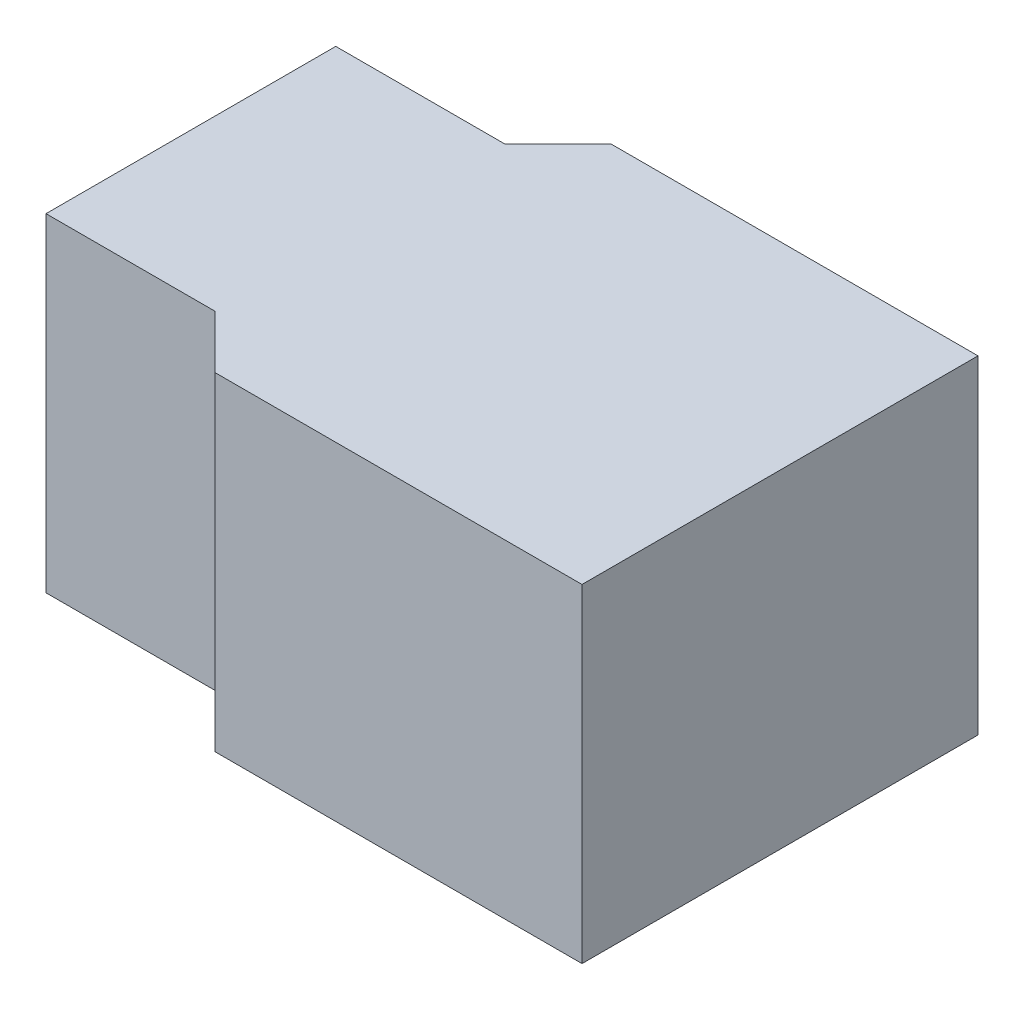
ISO-10303-21;
HEADER;
FILE_DESCRIPTION(('STEP AP214'),'2;1');
FILE_NAME('part.step','',(''),(''),'','','');
FILE_SCHEMA(('AUTOMOTIVE_DESIGN { 1 0 10303 214 1 1 1 1 }'));
ENDSEC;
DATA;
#1=APPLICATION_CONTEXT('core data for automotive mechanical design processes');
#2=APPLICATION_PROTOCOL_DEFINITION('international standard','automotive_design',2000,#1);
#3=PRODUCT_CONTEXT('',#1,'mechanical');
#4=PRODUCT('Part','Part','',(#3));
#5=PRODUCT_RELATED_PRODUCT_CATEGORY('part','',(#4));
#6=PRODUCT_DEFINITION_FORMATION('','',#4);
#7=PRODUCT_DEFINITION_CONTEXT('part definition',#1,'design');
#8=PRODUCT_DEFINITION('design','',#6,#7);
#9=PRODUCT_DEFINITION_SHAPE('','',#8);
#10=(LENGTH_UNIT() NAMED_UNIT(*) SI_UNIT(.MILLI.,.METRE.));
#11=(NAMED_UNIT(*) PLANE_ANGLE_UNIT() SI_UNIT($,.RADIAN.));
#12=(NAMED_UNIT(*) SI_UNIT($,.STERADIAN.) SOLID_ANGLE_UNIT());
#13=UNCERTAINTY_MEASURE_WITH_UNIT(LENGTH_MEASURE(1.E-05),#10,'distance_accuracy_value','');
#14=(GEOMETRIC_REPRESENTATION_CONTEXT(3) GLOBAL_UNCERTAINTY_ASSIGNED_CONTEXT((#13)) GLOBAL_UNIT_ASSIGNED_CONTEXT((#10,
#11,#12)) REPRESENTATION_CONTEXT('',''));
#15=CARTESIAN_POINT('',(0.,0.,0.));
#16=DIRECTION('',(0.,0.,1.));
#17=DIRECTION('',(1.,0.,0.));
#18=AXIS2_PLACEMENT_3D('',#15,#16,#17);
#19=CARTESIAN_POINT('',(0.,0.34,0.));
#20=DIRECTION('',(0.,1.,0.));
#21=DIRECTION('',(0.,0.,1.));
#22=AXIS2_PLACEMENT_3D('',#19,#20,#21);
#23=PLANE('',#22);
#24=DIRECTION('',(0.,0.,1.));
#25=VECTOR('',#24,1.);
#26=CARTESIAN_POINT('',(-3.,0.34,0.));
#27=LINE('',#26,#25);
#28=CARTESIAN_POINT('',(-3.,0.34,-1.755));
#29=VERTEX_POINT('',#28);
#30=CARTESIAN_POINT('',(-3.,0.34,-2.055));
#31=VERTEX_POINT('',#30);
#32=EDGE_CURVE('E114',#29,#31,#27,.F.);
#33=ORIENTED_EDGE('',*,*,#32,.F.);
#34=DIRECTION('',(1.,0.,0.));
#35=VECTOR('',#34,1.);
#36=CARTESIAN_POINT('',(0.,0.34,-1.755));
#37=LINE('',#36,#35);
#38=CARTESIAN_POINT('',(-2.825,0.339999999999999,-1.755));
#39=VERTEX_POINT('',#38);
#40=EDGE_CURVE('E118',#39,#29,#37,.F.);
#41=ORIENTED_EDGE('',*,*,#40,.F.);
#42=DIRECTION('',(0.707106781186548,0.,0.707106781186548));
#43=VECTOR('',#42,1.);
#44=CARTESIAN_POINT('',(-0.535,0.339999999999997,0.535));
#45=LINE('',#44,#43);
#46=CARTESIAN_POINT('',(-2.77,0.339999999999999,-1.7));
#47=VERTEX_POINT('',#46);
#48=EDGE_CURVE('E95',#47,#39,#45,.F.);
#49=ORIENTED_EDGE('',*,*,#48,.F.);
#50=DIRECTION('',(1.,0.,0.));
#51=VECTOR('',#50,1.);
#52=CARTESIAN_POINT('',(0.,0.34,-1.7));
#53=LINE('',#52,#51);
#54=CARTESIAN_POINT('',(-2.39,0.34,-1.7));
#55=VERTEX_POINT('',#54);
#56=EDGE_CURVE('E20',#55,#47,#53,.F.);
#57=ORIENTED_EDGE('',*,*,#56,.F.);
#58=DIRECTION('',(0.,0.,-1.));
#59=VECTOR('',#58,1.);
#60=CARTESIAN_POINT('',(-2.39,0.34,0.));
#61=LINE('',#60,#59);
#62=CARTESIAN_POINT('',(-2.39,0.34,-2.11));
#63=VERTEX_POINT('',#62);
#64=EDGE_CURVE('E83',#63,#55,#61,.F.);
#65=ORIENTED_EDGE('',*,*,#64,.F.);
#66=DIRECTION('',(-1.,0.,0.));
#67=VECTOR('',#66,1.);
#68=CARTESIAN_POINT('',(0.,0.34,-2.11));
#69=LINE('',#68,#67);
#70=CARTESIAN_POINT('',(-2.77,0.339999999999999,-2.11));
#71=VERTEX_POINT('',#70);
#72=EDGE_CURVE('E78',#71,#63,#69,.F.);
#73=ORIENTED_EDGE('',*,*,#72,.F.);
#74=DIRECTION('',(-0.707106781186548,0.,0.707106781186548));
#75=VECTOR('',#74,1.);
#76=CARTESIAN_POINT('',(-2.44,0.339999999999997,-2.44));
#77=LINE('',#76,#75);
#78=CARTESIAN_POINT('',(-2.825,0.339999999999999,-2.055));
#79=VERTEX_POINT('',#78);
#80=EDGE_CURVE('E106',#79,#71,#77,.F.);
#81=ORIENTED_EDGE('',*,*,#80,.F.);
#82=DIRECTION('',(-1.,0.,0.));
#83=VECTOR('',#82,1.);
#84=CARTESIAN_POINT('',(0.,0.34,-2.055));
#85=LINE('',#84,#83);
#86=EDGE_CURVE('E110',#31,#79,#85,.F.);
#87=ORIENTED_EDGE('',*,*,#86,.F.);
#88=EDGE_LOOP('',(#33,#41,#49,#57,#65,#73,#81,#87));
#89=FACE_BOUND('',#88,.T.);
#90=ADVANCED_FACE('F17',(#89),#23,.T.);
#91=CARTESIAN_POINT('',(0.,6.852610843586,-1.7));
#92=DIRECTION('',(0.,0.,1.));
#93=DIRECTION('',(1.,0.,0.));
#94=AXIS2_PLACEMENT_3D('',#91,#92,#93);
#95=PLANE('',#94);
#96=DIRECTION('',(0.,1.,0.));
#97=VECTOR('',#96,1.);
#98=CARTESIAN_POINT('',(-2.77,6.852610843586,-1.7));
#99=LINE('',#98,#97);
#100=CARTESIAN_POINT('',(-2.77,0.,-1.7));
#101=VERTEX_POINT('',#100);
#102=EDGE_CURVE('E122',#101,#47,#99,.T.);
#103=ORIENTED_EDGE('',*,*,#102,.F.);
#104=DIRECTION('',(1.,0.,0.));
#105=VECTOR('',#104,1.);
#106=CARTESIAN_POINT('',(0.,0.,-1.7));
#107=LINE('',#106,#105);
#108=CARTESIAN_POINT('',(-2.39,0.,-1.7));
#109=VERTEX_POINT('',#108);
#110=EDGE_CURVE('E101',#101,#109,#107,.T.);
#111=ORIENTED_EDGE('',*,*,#110,.T.);
#112=DIRECTION('',(0.,1.,0.));
#113=VECTOR('',#112,1.);
#114=CARTESIAN_POINT('',(-2.39,6.852610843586,-1.7));
#115=LINE('',#114,#113);
#116=EDGE_CURVE('E88',#55,#109,#115,.F.);
#117=ORIENTED_EDGE('',*,*,#116,.F.);
#118=ORIENTED_EDGE('',*,*,#56,.T.);
#119=EDGE_LOOP('',(#103,#111,#117,#118));
#120=FACE_BOUND('',#119,.T.);
#121=ADVANCED_FACE('F100',(#120),#95,.T.);
#122=CARTESIAN_POINT('',(-2.39,6.852610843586,0.));
#123=DIRECTION('',(1.,0.,0.));
#124=DIRECTION('',(0.,0.,-1.));
#125=AXIS2_PLACEMENT_3D('',#122,#123,#124);
#126=PLANE('',#125);
#127=ORIENTED_EDGE('',*,*,#116,.T.);
#128=DIRECTION('',(0.,0.,1.));
#129=VECTOR('',#128,1.);
#130=CARTESIAN_POINT('',(-2.39,0.,0.));
#131=LINE('',#130,#129);
#132=CARTESIAN_POINT('',(-2.39,0.,-2.11));
#133=VERTEX_POINT('',#132);
#134=EDGE_CURVE('E127',#109,#133,#131,.F.);
#135=ORIENTED_EDGE('',*,*,#134,.T.);
#136=DIRECTION('',(0.,1.,0.));
#137=VECTOR('',#136,1.);
#138=CARTESIAN_POINT('',(-2.39,6.852610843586,-2.11));
#139=LINE('',#138,#137);
#140=EDGE_CURVE('E90',#63,#133,#139,.F.);
#141=ORIENTED_EDGE('',*,*,#140,.F.);
#142=ORIENTED_EDGE('',*,*,#64,.T.);
#143=EDGE_LOOP('',(#127,#135,#141,#142));
#144=FACE_BOUND('',#143,.T.);
#145=ADVANCED_FACE('F85',(#144),#126,.T.);
#146=CARTESIAN_POINT('',(0.,6.852610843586,-2.11));
#147=DIRECTION('',(0.,0.,-1.));
#148=DIRECTION('',(-1.,0.,0.));
#149=AXIS2_PLACEMENT_3D('',#146,#147,#148);
#150=PLANE('',#149);
#151=ORIENTED_EDGE('',*,*,#140,.T.);
#152=DIRECTION('',(1.,0.,0.));
#153=VECTOR('',#152,1.);
#154=CARTESIAN_POINT('',(0.,0.,-2.11));
#155=LINE('',#154,#153);
#156=CARTESIAN_POINT('',(-2.77,0.,-2.11));
#157=VERTEX_POINT('',#156);
#158=EDGE_CURVE('E129',#133,#157,#155,.F.);
#159=ORIENTED_EDGE('',*,*,#158,.T.);
#160=DIRECTION('',(0.,1.,0.));
#161=VECTOR('',#160,1.);
#162=CARTESIAN_POINT('',(-2.77,6.852610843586,-2.11));
#163=LINE('',#162,#161);
#164=EDGE_CURVE('E108',#71,#157,#163,.F.);
#165=ORIENTED_EDGE('',*,*,#164,.F.);
#166=ORIENTED_EDGE('',*,*,#72,.T.);
#167=EDGE_LOOP('',(#151,#159,#165,#166));
#168=FACE_BOUND('',#167,.T.);
#169=ADVANCED_FACE('F162',(#168),#150,.T.);
#170=CARTESIAN_POINT('',(-2.44,6.852610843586,-2.44));
#171=DIRECTION('',(-0.707106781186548,0.,-0.707106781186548));
#172=DIRECTION('',(-0.707106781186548,0.,0.707106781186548));
#173=AXIS2_PLACEMENT_3D('',#170,#171,#172);
#174=PLANE('',#173);
#175=ORIENTED_EDGE('',*,*,#164,.T.);
#176=DIRECTION('',(-0.707106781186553,0.,0.707106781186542));
#177=VECTOR('',#176,1.);
#178=CARTESIAN_POINT('',(-2.77,0.,-2.11));
#179=LINE('',#178,#177);
#180=CARTESIAN_POINT('',(-2.825,0.,-2.055));
#181=VERTEX_POINT('',#180);
#182=EDGE_CURVE('E132',#157,#181,#179,.T.);
#183=ORIENTED_EDGE('',*,*,#182,.T.);
#184=DIRECTION('',(0.,1.,0.));
#185=VECTOR('',#184,1.);
#186=CARTESIAN_POINT('',(-2.825,6.852610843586,-2.05499999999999));
#187=LINE('',#186,#185);
#188=EDGE_CURVE('E112',#79,#181,#187,.F.);
#189=ORIENTED_EDGE('',*,*,#188,.F.);
#190=ORIENTED_EDGE('',*,*,#80,.T.);
#191=EDGE_LOOP('',(#175,#183,#189,#190));
#192=FACE_BOUND('',#191,.T.);
#193=ADVANCED_FACE('F161',(#192),#174,.T.);
#194=CARTESIAN_POINT('',(0.,6.852610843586,-2.055));
#195=DIRECTION('',(0.,0.,-1.));
#196=DIRECTION('',(-1.,0.,0.));
#197=AXIS2_PLACEMENT_3D('',#194,#195,#196);
#198=PLANE('',#197);
#199=ORIENTED_EDGE('',*,*,#188,.T.);
#200=DIRECTION('',(1.,0.,0.));
#201=VECTOR('',#200,1.);
#202=CARTESIAN_POINT('',(0.,0.,-2.055));
#203=LINE('',#202,#201);
#204=CARTESIAN_POINT('',(-3.,0.,-2.05499999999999));
#205=VERTEX_POINT('',#204);
#206=EDGE_CURVE('E135',#181,#205,#203,.F.);
#207=ORIENTED_EDGE('',*,*,#206,.T.);
#208=DIRECTION('',(0.,1.,0.));
#209=VECTOR('',#208,1.);
#210=CARTESIAN_POINT('',(-3.,6.852610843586,-2.055));
#211=LINE('',#210,#209);
#212=EDGE_CURVE('E116',#31,#205,#211,.F.);
#213=ORIENTED_EDGE('',*,*,#212,.F.);
#214=ORIENTED_EDGE('',*,*,#86,.T.);
#215=EDGE_LOOP('',(#199,#207,#213,#214));
#216=FACE_BOUND('',#215,.T.);
#217=ADVANCED_FACE('F155',(#216),#198,.T.);
#218=CARTESIAN_POINT('',(-3.,6.852610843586,0.));
#219=DIRECTION('',(-1.,0.,0.));
#220=DIRECTION('',(0.,0.,1.));
#221=AXIS2_PLACEMENT_3D('',#218,#219,#220);
#222=PLANE('',#221);
#223=ORIENTED_EDGE('',*,*,#212,.T.);
#224=DIRECTION('',(0.,0.,1.));
#225=VECTOR('',#224,1.);
#226=CARTESIAN_POINT('',(-3.,0.,0.));
#227=LINE('',#226,#225);
#228=CARTESIAN_POINT('',(-3.,0.,-1.755));
#229=VERTEX_POINT('',#228);
#230=EDGE_CURVE('E138',#205,#229,#227,.T.);
#231=ORIENTED_EDGE('',*,*,#230,.T.);
#232=DIRECTION('',(0.,1.,0.));
#233=VECTOR('',#232,1.);
#234=CARTESIAN_POINT('',(-3.,6.852610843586,-1.75499999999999));
#235=LINE('',#234,#233);
#236=EDGE_CURVE('E120',#29,#229,#235,.F.);
#237=ORIENTED_EDGE('',*,*,#236,.F.);
#238=ORIENTED_EDGE('',*,*,#32,.T.);
#239=EDGE_LOOP('',(#223,#231,#237,#238));
#240=FACE_BOUND('',#239,.T.);
#241=ADVANCED_FACE('F151',(#240),#222,.T.);
#242=CARTESIAN_POINT('',(0.,6.852610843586,-1.755));
#243=DIRECTION('',(0.,0.,1.));
#244=DIRECTION('',(1.,0.,0.));
#245=AXIS2_PLACEMENT_3D('',#242,#243,#244);
#246=PLANE('',#245);
#247=ORIENTED_EDGE('',*,*,#236,.T.);
#248=DIRECTION('',(1.,0.,0.));
#249=VECTOR('',#248,1.);
#250=CARTESIAN_POINT('',(0.,0.,-1.755));
#251=LINE('',#250,#249);
#252=CARTESIAN_POINT('',(-2.825,0.,-1.755));
#253=VERTEX_POINT('',#252);
#254=EDGE_CURVE('E26',#229,#253,#251,.T.);
#255=ORIENTED_EDGE('',*,*,#254,.T.);
#256=DIRECTION('',(0.,1.,0.));
#257=VECTOR('',#256,1.);
#258=CARTESIAN_POINT('',(-2.825,6.852610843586,-1.755));
#259=LINE('',#258,#257);
#260=EDGE_CURVE('E34',#39,#253,#259,.F.);
#261=ORIENTED_EDGE('',*,*,#260,.F.);
#262=ORIENTED_EDGE('',*,*,#40,.T.);
#263=EDGE_LOOP('',(#247,#255,#261,#262));
#264=FACE_BOUND('',#263,.T.);
#265=ADVANCED_FACE('F144',(#264),#246,.T.);
#266=CARTESIAN_POINT('',(-0.535,6.852610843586,0.535));
#267=DIRECTION('',(-0.707106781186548,0.,0.707106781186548));
#268=DIRECTION('',(0.707106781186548,0.,0.707106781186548));
#269=AXIS2_PLACEMENT_3D('',#266,#267,#268);
#270=PLANE('',#269);
#271=ORIENTED_EDGE('',*,*,#260,.T.);
#272=DIRECTION('',(0.70710678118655,0.,0.707106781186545));
#273=VECTOR('',#272,1.);
#274=CARTESIAN_POINT('',(-2.825,0.,-1.755));
#275=LINE('',#274,#273);
#276=EDGE_CURVE('E11',#253,#101,#275,.T.);
#277=ORIENTED_EDGE('',*,*,#276,.T.);
#278=ORIENTED_EDGE('',*,*,#102,.T.);
#279=ORIENTED_EDGE('',*,*,#48,.T.);
#280=EDGE_LOOP('',(#271,#277,#278,#279));
#281=FACE_BOUND('',#280,.T.);
#282=ADVANCED_FACE('F163',(#281),#270,.T.);
#283=CARTESIAN_POINT('',(0.,0.,0.));
#284=DIRECTION('',(0.,1.,0.));
#285=DIRECTION('',(0.,0.,1.));
#286=AXIS2_PLACEMENT_3D('',#283,#284,#285);
#287=PLANE('',#286);
#288=ORIENTED_EDGE('',*,*,#254,.F.);
#289=ORIENTED_EDGE('',*,*,#230,.F.);
#290=ORIENTED_EDGE('',*,*,#206,.F.);
#291=ORIENTED_EDGE('',*,*,#182,.F.);
#292=ORIENTED_EDGE('',*,*,#158,.F.);
#293=ORIENTED_EDGE('',*,*,#134,.F.);
#294=ORIENTED_EDGE('',*,*,#110,.F.);
#295=ORIENTED_EDGE('',*,*,#276,.F.);
#296=EDGE_LOOP('',(#288,#289,#290,#291,#292,#293,#294,#295));
#297=FACE_BOUND('',#296,.T.);
#298=ADVANCED_FACE('F148',(#297),#287,.F.);
#299=CLOSED_SHELL('',(#90,#121,#145,#169,#193,#217,#241,#265,#282,#298));
#300=MANIFOLD_SOLID_BREP('B1',#299);
#301=ADVANCED_BREP_SHAPE_REPRESENTATION('',(#18,#300),#14);
#302=SHAPE_DEFINITION_REPRESENTATION(#9,#301);
ENDSEC;
END-ISO-10303-21;
